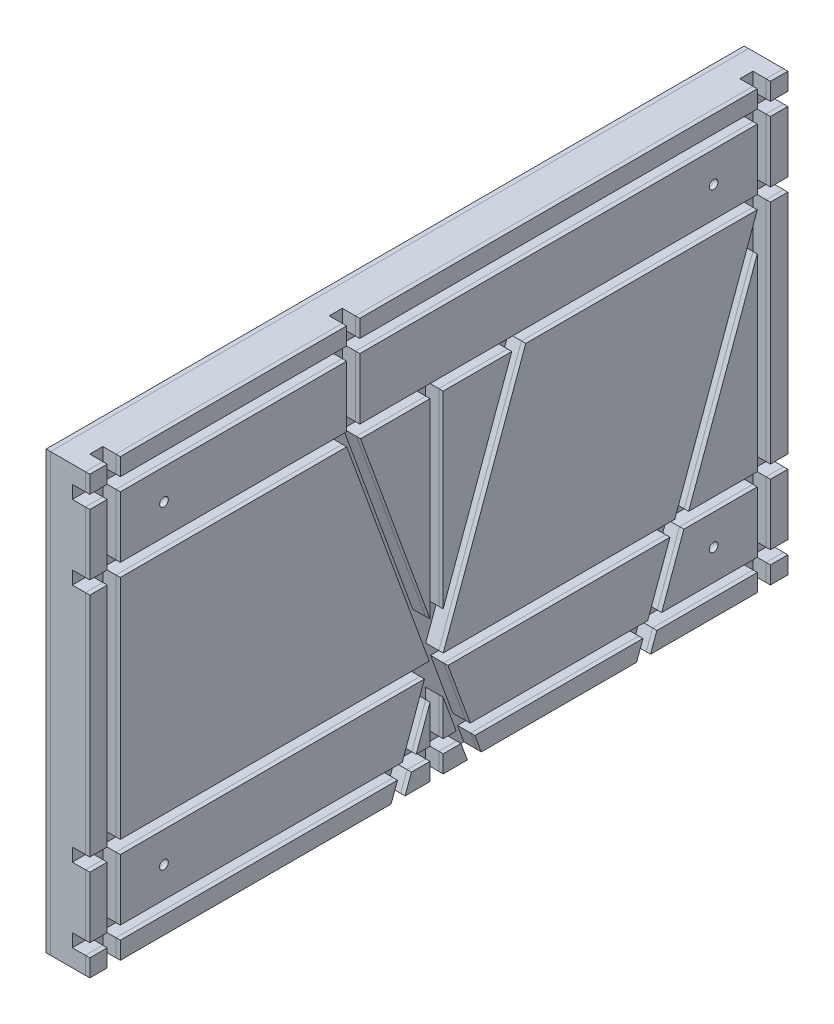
from build123d import *

# Parameters (mm, degrees)
ESQUISSE1_W             = 160
ESQUISSE1_H             = 100
EXTRUSION1_DEPTH        = 1
ESQUISSE2_W             = 160
ESQUISSE2_H             = 100
EXTRUSION4_DEPTH        = 8
ESQUISSE4_W             = 160
ESQUISSE4_H             = 100
EXTRUSION5_DEPTH        = 1
ESQUISSE5_W             = 3
ESQUISSE5_H             = 118.003052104
ESQUISSE5_H_2           = 114.049851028
ESQUISSE5_H_3           = 87.594506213
ENL_V_MAT_EXTRU_1_DEPTH = 4
ESQUISSE6_W             = 173.940847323
ESQUISSE6_H             = 3
ESQUISSE6_W_2           = 179.277668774
ESQUISSE6_W_3           = 177.696388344
ESQUISSE6_W_4           = 175.324467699
ENL_V_MAT_EXTRU_3_DEPTH = 4
ENL_V_MAT_EXTRU_4_DEPTH = 4
ENL_V_MAT_EXTRU_5_DEPTH = 4
ESQUISSE9_R             = 1
ENL_V_MAT_EXTRU_6_DEPTH = 189.944436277


with BuildPart() as part:
    # Esquisse1 → Extrusion1 (new body)
    with BuildSketch(Plane(origin=(0, 0, 0), x_dir=(0, 0, -1), z_dir=(1, 0, 0))):
        with Locations((80, 50)):
            Rectangle(ESQUISSE1_W, ESQUISSE1_H)
    extrude(amount=-EXTRUSION1_DEPTH)


with BuildPart() as body_2:
    # Esquisse2 → Extrusion4 (new body)
    with BuildSketch(Plane(origin=(-1, 0, 0), x_dir=(0, 0, -1), z_dir=(1, 0, 0))):
        with Locations((80, 50)):
            Rectangle(ESQUISSE2_W, ESQUISSE2_H)
    extrude(amount=-EXTRUSION4_DEPTH)


with BuildPart() as body_3:
    # Esquisse4 → Extrusion5 (new body)
    with BuildSketch(Plane.ZY.offset(9)):
        with Locations((-80, 50)):
            Rectangle(ESQUISSE4_W, ESQUISSE4_H)
    extrude(amount=EXTRUSION5_DEPTH)


with BuildPart() as enl_v_mat_extru_1_tool:
    # Esquisse5 → Enl_v. mat.-Extru.1 (new body)
    with BuildSketch(Plane(origin=(0, 0, 0), x_dir=(0, 0, -1), z_dir=(1, 0, 0))):
        with Locations((154.5, 49.407019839)):
            Rectangle(ESQUISSE5_W, ESQUISSE5_H)
        with Locations((5.5, 50)):
            Rectangle(ESQUISSE5_W, ESQUISSE5_H_2)
        with Locations((79.5, 34.202746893)):
            Rectangle(ESQUISSE5_W, ESQUISSE5_H_3)
    extrude(amount=-ENL_V_MAT_EXTRU_1_DEPTH)


with BuildPart() as part_1:
    add(part.part)

    # Enl_v. mat.-Extru.1: cut by enl_v_mat_extru_1_tool
    add(enl_v_mat_extru_1_tool.part, mode=Mode.SUBTRACT)


with BuildPart() as body_2_1:
    add(body_2.part)

    # Enl_v. mat.-Extru.1: cut by enl_v_mat_extru_1_tool
    add(enl_v_mat_extru_1_tool.part, mode=Mode.SUBTRACT)


with BuildPart() as enl_v_mat_extru_3_tool:
    # Esquisse6 → Enl_v. mat.-Extru.3 (new body)
    with BuildSketch(Plane(origin=(0, 0, 0), x_dir=(0, 0, -1), z_dir=(1, 0, 0))):
        with Locations((78.715209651, 94.5)):
            Rectangle(ESQUISSE6_W, ESQUISSE6_H)
        with Locations((74.860838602, 77.5)):
            Rectangle(ESQUISSE6_W_2, ESQUISSE6_H)
        with Locations((79.209359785, 5.5)):
            Rectangle(ESQUISSE6_W_3, ESQUISSE6_H)
        with Locations((78.023399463, 22.5)):
            Rectangle(ESQUISSE6_W_4, ESQUISSE6_H)
    extrude(amount=-ENL_V_MAT_EXTRU_3_DEPTH)


with BuildPart() as part_2:
    add(part_1.part)

    # Enl_v. mat.-Extru.3: cut by enl_v_mat_extru_3_tool
    add(enl_v_mat_extru_3_tool.part, mode=Mode.SUBTRACT)


with BuildPart() as body_2_2:
    add(body_2_1.part)

    # Enl_v. mat.-Extru.3: cut by enl_v_mat_extru_3_tool
    add(enl_v_mat_extru_3_tool.part, mode=Mode.SUBTRACT)


with BuildPart() as enl_v_mat_extru_4_tool:
    # Esquisse7 → Enl_v. mat.-Extru.4 (new body)
    with BuildSketch(Plane(origin=(0, 0, 0), x_dir=(0, 0, -1), z_dir=(1, 0, 0))):
        Polygon((125.338262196, 0), (153, 76), (153.931086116, 69.786724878), (128.273111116, -0.707982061), align=None)
        Polygon((81, 24), (99.926452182, 76), (97.397983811, 77.824503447), (68.796061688, -0.75863174), (72.264714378, 0), align=None)
    extrude(amount=-ENL_V_MAT_EXTRU_4_DEPTH)


with BuildPart() as part_3:
    add(part_2.part)

    # Enl_v. mat.-Extru.4: cut by enl_v_mat_extru_4_tool
    add(enl_v_mat_extru_4_tool.part, mode=Mode.SUBTRACT)


with BuildPart() as body_2_3:
    add(body_2_2.part)

    # Enl_v. mat.-Extru.4: cut by enl_v_mat_extru_4_tool
    add(enl_v_mat_extru_4_tool.part, mode=Mode.SUBTRACT)


with BuildPart() as enl_v_mat_extru_5_tool:
    # Esquisse8 → Enl_v. mat.-Extru.5 (new body)
    with BuildSketch(Plane(origin=(0, 0, 0), x_dir=(0, 0, -1), z_dir=(1, 0, 0))):
        Polygon((58.881014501, 76), (86.542752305, 0), (91.757238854, -5.555270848), (61.881014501, 76.528980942), (61.881014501, 105.212230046), (58.881014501, 105.212230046), align=None)
    extrude(amount=-ENL_V_MAT_EXTRU_5_DEPTH)


with BuildPart() as part_4:
    add(part_3.part)

    # Enl_v. mat.-Extru.5: cut by enl_v_mat_extru_5_tool
    add(enl_v_mat_extru_5_tool.part, mode=Mode.SUBTRACT)


with BuildPart() as body_2_4:
    add(body_2_3.part)

    # Enl_v. mat.-Extru.5: cut by enl_v_mat_extru_5_tool
    add(enl_v_mat_extru_5_tool.part, mode=Mode.SUBTRACT)


with BuildPart() as enl_v_mat_extru_6_tool:
    # Esquisse9 → Enl_v. mat.-Extru.6 (new, through all)
    with BuildSketch(Plane(origin=(0, 0, 0), x_dir=(0, 0, -1), z_dir=(1, 0, 0))):
        with Locations((143, 86)):
            Circle(ESQUISSE9_R)
        with Locations((17, 86)):
            Circle(ESQUISSE9_R)
        with Locations(Location((17, 14, 0), (0, 0, 180))):
            Circle(ESQUISSE9_R)
        with Locations(Location((143, 14, 0), (0, 0, 180))):
            Circle(ESQUISSE9_R)
    extrude(amount=-ENL_V_MAT_EXTRU_6_DEPTH)


with BuildPart() as part_5:
    add(part_4.part)

    # Enl_v. mat.-Extru.6: cut by enl_v_mat_extru_6_tool
    add(enl_v_mat_extru_6_tool.part, mode=Mode.SUBTRACT)


with BuildPart() as body_2_5:
    add(body_2_4.part)

    # Enl_v. mat.-Extru.6: cut by enl_v_mat_extru_6_tool
    add(enl_v_mat_extru_6_tool.part, mode=Mode.SUBTRACT)


with BuildPart() as body_3_1:
    add(body_3.part)

    # Enl_v. mat.-Extru.6: cut by enl_v_mat_extru_6_tool
    add(enl_v_mat_extru_6_tool.part, mode=Mode.SUBTRACT)


solid = Compound([part_5.part, body_2_5.part, body_3_1.part])
